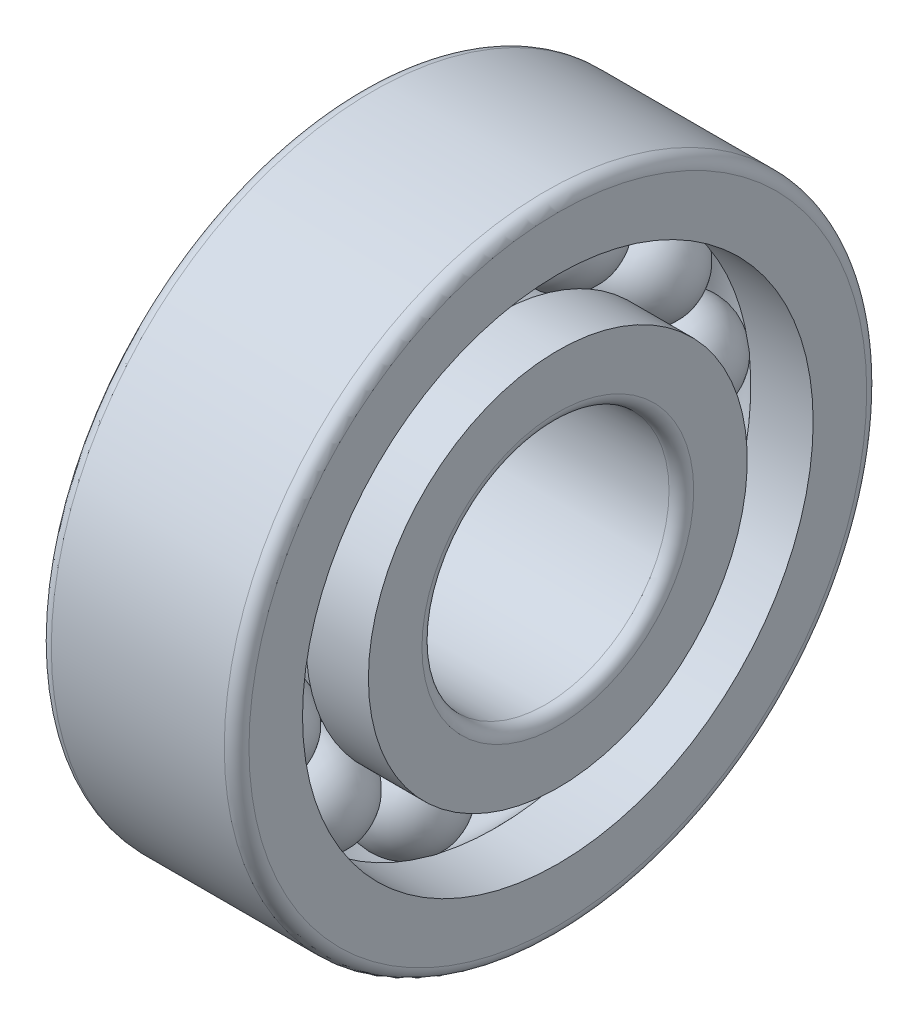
from build123d import *

# Parameters (mm, degrees)
CIRCULAR_PATTERN1_COUNT = 13
FILLET1_R               = 0.5


with BuildPart() as part:
    # Sketch1 → Revolve1 (revolve)
    with BuildSketch(Plane.XY):
        with BuildLine():
            Line((-2, 9), (2, 9))
            ThreePointArc((2, 9), (0, 11), (-2, 9))
        make_face()
    revolve1 = revolve(axis=Axis((-4.596601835, 9, 0), (1, 0, 0)))

    # Sketch2 → Revolve2 (revolve)
    with BuildSketch(Plane.XY, mode=Mode.PRIVATE) as revolve2_sk:
        with BuildLine():
            Line((-4, 7.666666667), (-4, 5))
            Line((-4, 5), (4, 5))
            Line((4, 5), (4, 7.666666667))
            Line((4, 7.666666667), (1.4772685, 7.666666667))
            ThreePointArc((1.4772685, 7.666666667), (0, 7.01), (-1.4772685, 7.666666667))
            Line((-1.4772685, 7.666666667), (-4, 7.666666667))
        make_face()
    revolve(revolve2_sk.sketch.rotate(Axis((-6.971390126, 0, 0), (1, 0, 0)), 90), axis=Axis((-6.971390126, 0, 0), (1, 0, 0)))

    # Sketch3 → Revolve3 (revolve)
    with BuildSketch(Plane.XY, mode=Mode.PRIVATE) as revolve3_sk:
        with BuildLine():
            Line((-4, 13), (4, 13))
            Line((4, 13), (4, 10.333333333))
            Line((4, 10.333333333), (1.4772685, 10.333333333))
            ThreePointArc((1.4772685, 10.333333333), (0, 10.99), (-1.4772685, 10.333333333))
            Line((-1.4772685, 10.333333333), (-4, 10.333333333))
            Line((-4, 10.333333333), (-4, 13))
        make_face()
    revolve(revolve3_sk.sketch.rotate(Axis((-8.710676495, 0, 0), (1, 0, 0)), 90), axis=Axis((-8.710676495, 0, 0), (1, 0, 0)))

    # Circular-Pattern1: Revolve1 ×13 about axis
    circular_pattern1_axis = Axis((0, 0, 0), (1, 0, 0))
    for i in range(1, CIRCULAR_PATTERN1_COUNT):
        add(revolve1.rotate(circular_pattern1_axis, i * 360 / CIRCULAR_PATTERN1_COUNT))

    # Fillet1
    fillet1_edges = [part.edges().sort_by_distance(p)[0] for p in [
        (-4, 0, -13),
        (4, 0, -13),
        (-4, 0, -5),
        (4, 0, -5),
    ]]
    fillet(fillet1_edges, radius=FILLET1_R)


solid = part.part
